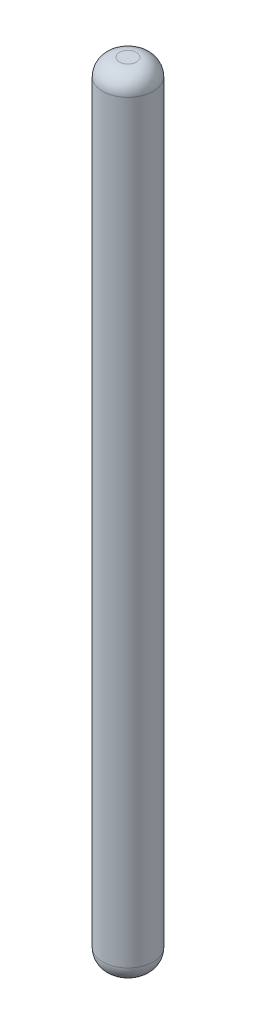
ISO-10303-21;
HEADER;
FILE_DESCRIPTION(('STEP AP214'),'2;1');
FILE_NAME('part.step','',(''),(''),'','','');
FILE_SCHEMA(('AUTOMOTIVE_DESIGN { 1 0 10303 214 1 1 1 1 }'));
ENDSEC;
DATA;
#1=APPLICATION_CONTEXT('core data for automotive mechanical design processes');
#2=APPLICATION_PROTOCOL_DEFINITION('international standard','automotive_design',2000,#1);
#3=PRODUCT_CONTEXT('',#1,'mechanical');
#4=PRODUCT('Part','Part','',(#3));
#5=PRODUCT_RELATED_PRODUCT_CATEGORY('part','',(#4));
#6=PRODUCT_DEFINITION_FORMATION('','',#4);
#7=PRODUCT_DEFINITION_CONTEXT('part definition',#1,'design');
#8=PRODUCT_DEFINITION('design','',#6,#7);
#9=PRODUCT_DEFINITION_SHAPE('','',#8);
#10=(LENGTH_UNIT() NAMED_UNIT(*) SI_UNIT(.MILLI.,.METRE.));
#11=(NAMED_UNIT(*) PLANE_ANGLE_UNIT() SI_UNIT($,.RADIAN.));
#12=(NAMED_UNIT(*) SI_UNIT($,.STERADIAN.) SOLID_ANGLE_UNIT());
#13=UNCERTAINTY_MEASURE_WITH_UNIT(LENGTH_MEASURE(1.E-05),#10,'distance_accuracy_value','');
#14=(GEOMETRIC_REPRESENTATION_CONTEXT(3) GLOBAL_UNCERTAINTY_ASSIGNED_CONTEXT((#13)) GLOBAL_UNIT_ASSIGNED_CONTEXT((#10,
#11,#12)) REPRESENTATION_CONTEXT('',''));
#15=CARTESIAN_POINT('',(0.,0.,0.));
#16=DIRECTION('',(0.,0.,1.));
#17=DIRECTION('',(1.,0.,0.));
#18=AXIS2_PLACEMENT_3D('',#15,#16,#17);
#19=CARTESIAN_POINT('',(0.,140.,0.));
#20=DIRECTION('',(0.,-1.,0.));
#21=DIRECTION('',(0.,0.,-1.));
#22=AXIS2_PLACEMENT_3D('',#19,#20,#21);
#23=CYLINDRICAL_SURFACE('',#22,4.5);
#24=CARTESIAN_POINT('',(0.,3.,0.));
#25=DIRECTION('',(0.,1.,0.));
#26=DIRECTION('',(0.,0.,1.));
#27=AXIS2_PLACEMENT_3D('',#24,#25,#26);
#28=CIRCLE('',#27,4.5);
#29=CARTESIAN_POINT('',(0.,3.,4.5));
#30=VERTEX_POINT('',#29);
#31=EDGE_CURVE('E45',#30,#30,#28,.T.);
#32=ORIENTED_EDGE('',*,*,#31,.T.);
#33=EDGE_LOOP('',(#32));
#34=FACE_BOUND('',#33,.T.);
#35=CARTESIAN_POINT('',(0.,137.,0.));
#36=DIRECTION('',(0.,1.,0.));
#37=DIRECTION('',(0.,0.,1.));
#38=AXIS2_PLACEMENT_3D('',#35,#36,#37);
#39=CIRCLE('',#38,4.5);
#40=CARTESIAN_POINT('',(0.,137.,4.5));
#41=VERTEX_POINT('',#40);
#42=EDGE_CURVE('E49',#41,#41,#39,.F.);
#43=ORIENTED_EDGE('',*,*,#42,.T.);
#44=EDGE_LOOP('',(#43));
#45=FACE_BOUND('',#44,.T.);
#46=ADVANCED_FACE('F34',(#34,#45),#23,.T.);
#47=CARTESIAN_POINT('',(0.,140.,0.));
#48=DIRECTION('',(0.,1.,0.));
#49=DIRECTION('',(0.,0.,1.));
#50=AXIS2_PLACEMENT_3D('',#47,#48,#49);
#51=PLANE('',#50);
#52=CARTESIAN_POINT('',(0.,140.,0.));
#53=DIRECTION('',(0.,1.,0.));
#54=DIRECTION('',(0.,0.,1.));
#55=AXIS2_PLACEMENT_3D('',#52,#53,#54);
#56=CIRCLE('',#55,1.5);
#57=CARTESIAN_POINT('',(0.,140.,1.5));
#58=VERTEX_POINT('',#57);
#59=EDGE_CURVE('E10',#58,#58,#56,.T.);
#60=ORIENTED_EDGE('',*,*,#59,.T.);
#61=EDGE_LOOP('',(#60));
#62=FACE_BOUND('',#61,.T.);
#63=ADVANCED_FACE('F65',(#62),#51,.T.);
#64=CARTESIAN_POINT('',(0.,0.,0.));
#65=DIRECTION('',(0.,1.,0.));
#66=DIRECTION('',(0.,0.,1.));
#67=AXIS2_PLACEMENT_3D('',#64,#65,#66);
#68=PLANE('',#67);
#69=CARTESIAN_POINT('',(0.,0.,0.));
#70=DIRECTION('',(0.,1.,0.));
#71=DIRECTION('',(0.,0.,1.));
#72=AXIS2_PLACEMENT_3D('',#69,#70,#71);
#73=CIRCLE('',#72,1.5);
#74=CARTESIAN_POINT('',(0.,0.,1.5));
#75=VERTEX_POINT('',#74);
#76=EDGE_CURVE('E41',#75,#75,#73,.F.);
#77=ORIENTED_EDGE('',*,*,#76,.T.);
#78=EDGE_LOOP('',(#77));
#79=FACE_BOUND('',#78,.T.);
#80=ADVANCED_FACE('F62',(#79),#68,.F.);
#81=CARTESIAN_POINT('',(0.,3.,0.));
#82=DIRECTION('',(0.,1.,0.));
#83=DIRECTION('',(0.,0.,1.));
#84=AXIS2_PLACEMENT_3D('',#81,#82,#83);
#85=DEGENERATE_TOROIDAL_SURFACE('',#84,1.5,3.,.T.);
#86=ORIENTED_EDGE('',*,*,#76,.F.);
#87=EDGE_LOOP('',(#86));
#88=FACE_BOUND('',#87,.T.);
#89=ORIENTED_EDGE('',*,*,#31,.F.);
#90=EDGE_LOOP('',(#89));
#91=FACE_BOUND('',#90,.T.);
#92=ADVANCED_FACE('F58',(#88,#91),#85,.T.);
#93=CARTESIAN_POINT('',(0.,137.,0.));
#94=DIRECTION('',(0.,1.,0.));
#95=DIRECTION('',(0.,0.,1.));
#96=AXIS2_PLACEMENT_3D('',#93,#94,#95);
#97=DEGENERATE_TOROIDAL_SURFACE('',#96,1.5,3.,.T.);
#98=ORIENTED_EDGE('',*,*,#42,.F.);
#99=EDGE_LOOP('',(#98));
#100=FACE_BOUND('',#99,.T.);
#101=ORIENTED_EDGE('',*,*,#59,.F.);
#102=EDGE_LOOP('',(#101));
#103=FACE_BOUND('',#102,.T.);
#104=ADVANCED_FACE('F36',(#100,#103),#97,.T.);
#105=CLOSED_SHELL('',(#46,#63,#80,#92,#104));
#106=MANIFOLD_SOLID_BREP('B2',#105);
#107=ADVANCED_BREP_SHAPE_REPRESENTATION('',(#18,#106),#14);
#108=SHAPE_DEFINITION_REPRESENTATION(#9,#107);
ENDSEC;
END-ISO-10303-21;
